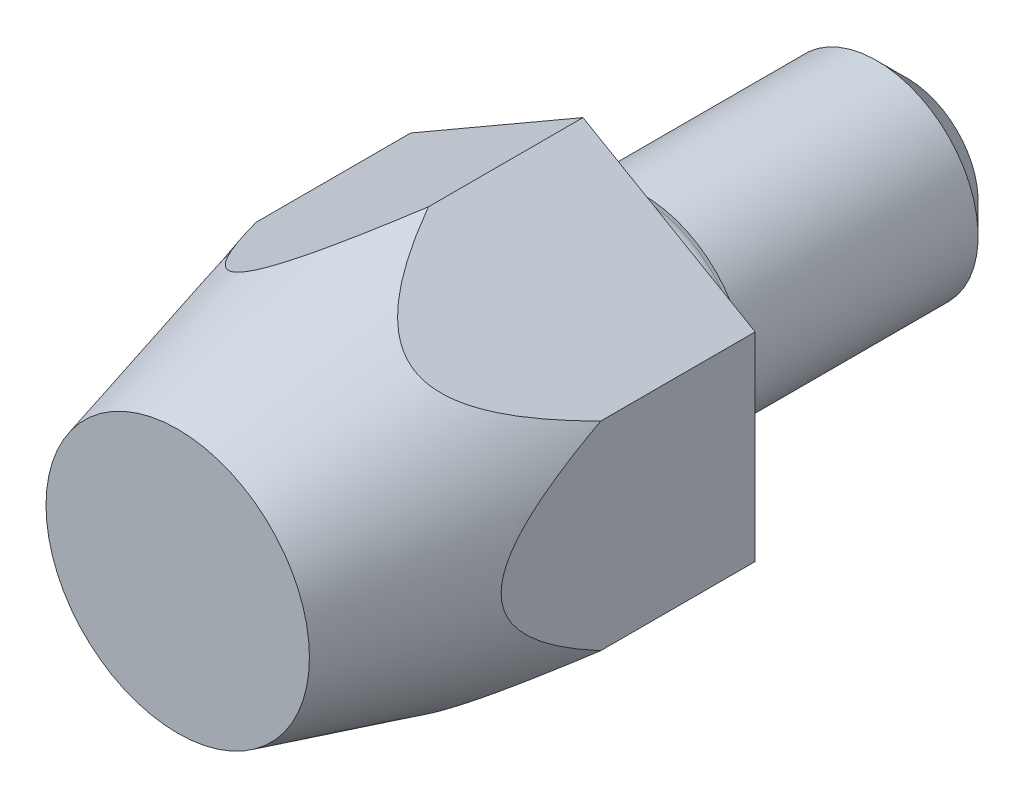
ISO-10303-21;
HEADER;
FILE_DESCRIPTION(('STEP AP214'),'2;1');
FILE_NAME('part.step','',(''),(''),'','','');
FILE_SCHEMA(('AUTOMOTIVE_DESIGN { 1 0 10303 214 1 1 1 1 }'));
ENDSEC;
DATA;
#1=APPLICATION_CONTEXT('core data for automotive mechanical design processes');
#2=APPLICATION_PROTOCOL_DEFINITION('international standard','automotive_design',2000,#1);
#3=PRODUCT_CONTEXT('',#1,'mechanical');
#4=PRODUCT('Part','Part','',(#3));
#5=PRODUCT_RELATED_PRODUCT_CATEGORY('part','',(#4));
#6=PRODUCT_DEFINITION_FORMATION('','',#4);
#7=PRODUCT_DEFINITION_CONTEXT('part definition',#1,'design');
#8=PRODUCT_DEFINITION('design','',#6,#7);
#9=PRODUCT_DEFINITION_SHAPE('','',#8);
#10=(LENGTH_UNIT() NAMED_UNIT(*) SI_UNIT(.MILLI.,.METRE.));
#11=(NAMED_UNIT(*) PLANE_ANGLE_UNIT() SI_UNIT($,.RADIAN.));
#12=(NAMED_UNIT(*) SI_UNIT($,.STERADIAN.) SOLID_ANGLE_UNIT());
#13=UNCERTAINTY_MEASURE_WITH_UNIT(LENGTH_MEASURE(1.E-05),#10,'distance_accuracy_value','');
#14=(GEOMETRIC_REPRESENTATION_CONTEXT(3) GLOBAL_UNCERTAINTY_ASSIGNED_CONTEXT((#13)) GLOBAL_UNIT_ASSIGNED_CONTEXT((#10,
#11,#12)) REPRESENTATION_CONTEXT('',''));
#15=CARTESIAN_POINT('',(0.,0.,0.));
#16=DIRECTION('',(0.,0.,1.));
#17=DIRECTION('',(1.,0.,0.));
#18=AXIS2_PLACEMENT_3D('',#15,#16,#17);
#19=CARTESIAN_POINT('',(-11.8589838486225,0.,0.));
#20=DIRECTION('',(0.,0.,-1.));
#21=DIRECTION('',(-1.,0.,0.));
#22=AXIS2_PLACEMENT_3D('',#19,#20,#21);
#23=PLANE('',#22);
#24=CARTESIAN_POINT('',(0.,0.,0.));
#25=DIRECTION('',(0.,0.,-1.));
#26=DIRECTION('',(-1.,0.,0.));
#27=AXIS2_PLACEMENT_3D('',#24,#25,#26);
#28=CIRCLE('',#27,4.8);
#29=CARTESIAN_POINT('',(-4.8,0.,0.));
#30=VERTEX_POINT('',#29);
#31=EDGE_CURVE('E22',#30,#30,#28,.F.);
#32=ORIENTED_EDGE('',*,*,#31,.T.);
#33=EDGE_LOOP('',(#32));
#34=FACE_BOUND('',#33,.T.);
#35=DIRECTION('',(0.,1.,0.));
#36=VECTOR('',#35,1.);
#37=CARTESIAN_POINT('',(8.5,-4.90747728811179,0.));
#38=LINE('',#37,#36);
#39=CARTESIAN_POINT('',(8.5,-4.90747728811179,0.));
#40=VERTEX_POINT('',#39);
#41=CARTESIAN_POINT('',(8.5,4.90747728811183,0.));
#42=VERTEX_POINT('',#41);
#43=EDGE_CURVE('E97',#40,#42,#38,.T.);
#44=ORIENTED_EDGE('',*,*,#43,.F.);
#45=DIRECTION('',(-0.866025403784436,-0.5,0.));
#46=VECTOR('',#45,1.);
#47=CARTESIAN_POINT('',(8.5,-4.90747728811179,0.));
#48=LINE('',#47,#46);
#49=CARTESIAN_POINT('',(0.,-9.81495457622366,0.));
#50=VERTEX_POINT('',#49);
#51=EDGE_CURVE('E90',#40,#50,#48,.T.);
#52=ORIENTED_EDGE('',*,*,#51,.T.);
#53=DIRECTION('',(0.866025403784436,-0.5,0.));
#54=VECTOR('',#53,1.);
#55=CARTESIAN_POINT('',(-8.5,-4.90747728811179,0.));
#56=LINE('',#55,#54);
#57=CARTESIAN_POINT('',(-8.5,-4.90747728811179,0.));
#58=VERTEX_POINT('',#57);
#59=EDGE_CURVE('E88',#58,#50,#56,.T.);
#60=ORIENTED_EDGE('',*,*,#59,.F.);
#61=DIRECTION('',(0.,1.,0.));
#62=VECTOR('',#61,1.);
#63=CARTESIAN_POINT('',(-8.5,-4.90747728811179,0.));
#64=LINE('',#63,#62);
#65=CARTESIAN_POINT('',(-8.5,4.90747728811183,0.));
#66=VERTEX_POINT('',#65);
#67=EDGE_CURVE('E37',#58,#66,#64,.T.);
#68=ORIENTED_EDGE('',*,*,#67,.T.);
#69=DIRECTION('',(0.86602540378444,0.5,0.));
#70=VECTOR('',#69,1.);
#71=CARTESIAN_POINT('',(-8.5,4.90747728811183,0.));
#72=LINE('',#71,#70);
#73=CARTESIAN_POINT('',(0.,9.81495457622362,0.));
#74=VERTEX_POINT('',#73);
#75=EDGE_CURVE('E77',#66,#74,#72,.T.);
#76=ORIENTED_EDGE('',*,*,#75,.T.);
#77=DIRECTION('',(-0.86602540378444,0.5,0.));
#78=VECTOR('',#77,1.);
#79=CARTESIAN_POINT('',(8.5,4.90747728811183,0.));
#80=LINE('',#79,#78);
#81=EDGE_CURVE('E83',#42,#74,#80,.T.);
#82=ORIENTED_EDGE('',*,*,#81,.F.);
#83=EDGE_LOOP('',(#44,#52,#60,#68,#76,#82));
#84=FACE_BOUND('',#83,.T.);
#85=ADVANCED_FACE('F14',(#34,#84),#23,.T.);
#86=CARTESIAN_POINT('',(8.5,-4.90747728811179,30.));
#87=DIRECTION('',(0.5,-0.866025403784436,0.));
#88=DIRECTION('',(0.866025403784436,0.5,0.));
#89=AXIS2_PLACEMENT_3D('',#86,#87,#88);
#90=PLANE('',#89);
#91=DIRECTION('',(0.,0.,-1.));
#92=VECTOR('',#91,1.);
#93=CARTESIAN_POINT('',(0.,-9.81495457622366,30.));
#94=LINE('',#93,#92);
#95=CARTESIAN_POINT('',(0.,-9.8149545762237,7.62842109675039));
#96=VERTEX_POINT('',#95);
#97=EDGE_CURVE('E29',#96,#50,#94,.T.);
#98=ORIENTED_EDGE('',*,*,#97,.T.);
#99=ORIENTED_EDGE('',*,*,#51,.F.);
#100=DIRECTION('',(0.,0.,-1.));
#101=VECTOR('',#100,1.);
#102=CARTESIAN_POINT('',(8.5,-4.90747728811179,30.));
#103=LINE('',#102,#101);
#104=CARTESIAN_POINT('',(8.5,-4.90747728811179,7.62842109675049));
#105=VERTEX_POINT('',#104);
#106=EDGE_CURVE('E102',#105,#40,#103,.T.);
#107=ORIENTED_EDGE('',*,*,#106,.F.);
#108=CARTESIAN_POINT('',(-0.000200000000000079,-9.8150700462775,7.62799014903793));
#109=CARTESIAN_POINT('',(0.0565623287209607,-9.7822983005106,7.75029290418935));
#110=CARTESIAN_POINT('',(0.113980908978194,-9.74914766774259,7.87218853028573));
#111=CARTESIAN_POINT('',(0.23028254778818,-9.68200088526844,8.11505767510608));
#112=CARTESIAN_POINT('',(0.289165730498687,-9.64800466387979,8.23603111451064));
#113=CARTESIAN_POINT('',(0.468440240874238,-9.54450047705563,8.59780847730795));
#114=CARTESIAN_POINT('',(0.591253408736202,-9.4735942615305,8.83702862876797));
#115=CARTESIAN_POINT('',(0.846354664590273,-9.32631148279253,9.31259125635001));
#116=CARTESIAN_POINT('',(0.978737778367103,-9.24988005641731,9.54886604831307));
#117=CARTESIAN_POINT('',(1.25378264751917,-9.09108282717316,10.0131621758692));
#118=CARTESIAN_POINT('',(1.39643609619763,-9.00872182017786,10.2411899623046));
#119=CARTESIAN_POINT('',(1.61637758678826,-8.88173854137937,10.5679844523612));
#120=CARTESIAN_POINT('',(1.68842753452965,-8.84014048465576,10.6714546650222));
#121=CARTESIAN_POINT('',(1.83600172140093,-8.75493848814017,10.8750743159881));
#122=CARTESIAN_POINT('',(1.91152636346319,-8.71133431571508,10.9752233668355));
#123=CARTESIAN_POINT('',(2.0664957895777,-8.62186267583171,11.1713042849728));
#124=CARTESIAN_POINT('',(2.14593801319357,-8.57599668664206,11.2672388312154));
#125=CARTESIAN_POINT('',(2.3093516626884,-8.48164977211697,11.4537883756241));
#126=CARTESIAN_POINT('',(2.39332214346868,-8.43316939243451,11.5444044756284));
#127=CARTESIAN_POINT('',(2.61555054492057,-8.30486576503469,11.7683512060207));
#128=CARTESIAN_POINT('',(2.75760492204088,-8.22285063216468,11.8967851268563));
#129=CARTESIAN_POINT('',(3.05665849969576,-8.05019196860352,12.1279669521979));
#130=CARTESIAN_POINT('',(3.21361248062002,-7.95957454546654,12.2307893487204));
#131=CARTESIAN_POINT('',(3.48807751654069,-7.80111208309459,12.3698897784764));
#132=CARTESIAN_POINT('',(3.60143379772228,-7.73566580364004,12.4169283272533));
#133=CARTESIAN_POINT('',(3.83329039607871,-7.60180333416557,12.4889998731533));
#134=CARTESIAN_POINT('',(3.9517836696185,-7.53339121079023,12.5140620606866));
#135=CARTESIAN_POINT('',(4.19149502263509,-7.39499379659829,12.53911377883));
#136=CARTESIAN_POINT('',(4.31272475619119,-7.32500177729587,12.5389600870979));
#137=CARTESIAN_POINT('',(4.5531322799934,-7.18620242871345,12.5132499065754));
#138=CARTESIAN_POINT('',(4.67230877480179,-7.11739584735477,12.4876779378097));
#139=CARTESIAN_POINT('',(4.92988312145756,-6.96868522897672,12.4066601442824));
#140=CARTESIAN_POINT('',(5.06703611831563,-6.88949990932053,12.3460526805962));
#141=CARTESIAN_POINT('',(5.33126816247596,-6.73694546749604,12.2005195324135));
#142=CARTESIAN_POINT('',(5.45832337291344,-6.66359010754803,12.1155383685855));
#143=CARTESIAN_POINT('',(5.68877154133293,-6.53054079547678,11.9389162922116));
#144=CARTESIAN_POINT('',(5.79322360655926,-6.47023536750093,11.8490725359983));
#145=CARTESIAN_POINT('',(5.99515319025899,-6.35365126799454,11.65938757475));
#146=CARTESIAN_POINT('',(6.09262434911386,-6.29737626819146,11.5595374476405));
#147=CARTESIAN_POINT('',(6.28210577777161,-6.18797911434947,11.3517412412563));
#148=CARTESIAN_POINT('',(6.37407283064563,-6.13488191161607,11.243743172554));
#149=CARTESIAN_POINT('',(6.55266303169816,-6.03177281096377,11.0221313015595));
#150=CARTESIAN_POINT('',(6.63928830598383,-5.98175968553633,10.9085197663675));
#151=CARTESIAN_POINT('',(6.81304306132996,-5.88144233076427,10.6700093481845));
#152=CARTESIAN_POINT('',(6.89989417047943,-5.83129881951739,10.5448414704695));
#153=CARTESIAN_POINT('',(7.069272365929,-5.73350827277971,10.2906504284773));
#154=CARTESIAN_POINT('',(7.15179863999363,-5.68586170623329,10.1616265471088));
#155=CARTESIAN_POINT('',(7.39403516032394,-5.54600638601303,9.76967614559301));
#156=CARTESIAN_POINT('',(7.54818966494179,-5.45700524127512,9.50217249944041));
#157=CARTESIAN_POINT('',(7.83980957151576,-5.28863840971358,8.96921965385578));
#158=CARTESIAN_POINT('',(7.97768204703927,-5.20903769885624,8.70406272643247));
#159=CARTESIAN_POINT('',(8.17815750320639,-5.09329314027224,8.30272384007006));
#160=CARTESIAN_POINT('',(8.24382448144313,-5.05538029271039,8.16856679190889));
#161=CARTESIAN_POINT('',(8.37333001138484,-4.980610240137,7.89910246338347));
#162=CARTESIAN_POINT('',(8.43716879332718,-4.94375290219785,7.76379533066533));
#163=CARTESIAN_POINT('',(8.50020000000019,-4.90736181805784,7.62799014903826));
#164=B_SPLINE_CURVE_WITH_KNOTS('',3,(#108,#109,#110,#111,#112,#113,#114,#115,#116,#117,#118,
#119,#120,#121,#122,#123,#124,#125,#126,#127,#128,#129,#130,#131,#132,#133,#134,#135,#136,#137,
#138,#139,#140,#141,#142,#143,#144,#145,#146,#147,#148,#149,#150,#151,#152,#153,#154,#155,#156,
#157,#158,#159,#160,#161,#162,#163),.UNSPECIFIED.,.F.,.F.,(4,2,2,2,2,2,2,2,2,2,2,2,2,2,2,2,2,2,
2,2,2,2,2,2,2,2,2,4),(0.,0.416269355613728,0.832574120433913,1.66668109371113,2.51067143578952,
3.35398666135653,3.75221416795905,4.15048797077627,4.54850483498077,4.94643894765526,
5.56989408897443,6.19151414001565,6.60723967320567,7.02241217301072,7.43994287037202,
7.85772800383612,8.36359455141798,8.87062181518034,9.32115341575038,9.7720903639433,
10.2261980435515,10.680123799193,11.1611365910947,11.6422393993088,12.6056109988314,
13.5332254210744,13.9955173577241,14.4577508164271),.UNSPECIFIED.);
#165=EDGE_CURVE('E157',#96,#105,#164,.T.);
#166=ORIENTED_EDGE('',*,*,#165,.F.);
#167=EDGE_LOOP('',(#98,#99,#107,#166));
#168=FACE_BOUND('',#167,.T.);
#169=ADVANCED_FACE('F127',(#168),#90,.T.);
#170=CARTESIAN_POINT('',(8.5,-4.90747728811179,30.));
#171=DIRECTION('',(-1.,0.,0.));
#172=DIRECTION('',(0.,0.,1.));
#173=AXIS2_PLACEMENT_3D('',#170,#171,#172);
#174=PLANE('',#173);
#175=CARTESIAN_POINT('',(8.5,-10.0492779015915,-4.8628859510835));
#176=CARTESIAN_POINT('',(8.5,-9.85410268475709,-4.30687724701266));
#177=CARTESIAN_POINT('',(8.5,-9.65689373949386,-3.75157278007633));
#178=CARTESIAN_POINT('',(8.5,-9.25741342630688,-2.64267011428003));
#179=CARTESIAN_POINT('',(8.5,-9.05514110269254,-2.08907226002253));
#180=CARTESIAN_POINT('',(8.5,-8.64297065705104,-0.97967301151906));
#181=CARTESIAN_POINT('',(8.5,-8.4330244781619,-0.423889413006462));
#182=CARTESIAN_POINT('',(8.5,-8.00569416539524,0.684730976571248));
#183=CARTESIAN_POINT('',(8.5,-7.78831100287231,1.23756814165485));
#184=CARTESIAN_POINT('',(8.5,-7.31428291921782,2.41388203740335));
#185=CARTESIAN_POINT('',(8.5,-7.05629847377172,3.03682367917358));
#186=CARTESIAN_POINT('',(8.5,-6.6572799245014,3.96623738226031));
#187=CARTESIAN_POINT('',(8.5,-6.5222334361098,4.27528123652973));
#188=CARTESIAN_POINT('',(8.5,-6.24742270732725,4.89126326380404));
#189=CARTESIAN_POINT('',(8.5,-6.10765855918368,5.19820147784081));
#190=CARTESIAN_POINT('',(8.5,-5.82308398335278,5.80828138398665));
#191=CARTESIAN_POINT('',(8.5,-5.67829533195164,6.11143320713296));
#192=CARTESIAN_POINT('',(8.5,-5.38201744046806,6.71444147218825));
#193=CARTESIAN_POINT('',(8.5,-5.23052852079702,7.01429807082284));
#194=CARTESIAN_POINT('',(8.5,-4.91942475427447,7.60949511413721));
#195=CARTESIAN_POINT('',(8.5,-4.75981607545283,7.90483877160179));
#196=CARTESIAN_POINT('',(8.5,-4.4302954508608,8.48969606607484));
#197=CARTESIAN_POINT('',(8.5,-4.26038599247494,8.77921108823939));
#198=CARTESIAN_POINT('',(8.5,-4.0133208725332,9.17849342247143));
#199=CARTESIAN_POINT('',(8.5,-3.94177652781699,9.2917388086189));
#200=CARTESIAN_POINT('',(8.5,-3.79628704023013,9.51668328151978));
#201=CARTESIAN_POINT('',(8.5,-3.72234180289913,9.62838230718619));
#202=CARTESIAN_POINT('',(8.5,-3.49635051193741,9.96096268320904));
#203=CARTESIAN_POINT('',(8.5,-3.34026820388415,10.1791320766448));
#204=CARTESIAN_POINT('',(8.5,-3.0164983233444,10.6022478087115));
#205=CARTESIAN_POINT('',(8.5,-2.84899560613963,10.8073327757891));
#206=CARTESIAN_POINT('',(8.5,-2.58473089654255,11.1031284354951));
#207=CARTESIAN_POINT('',(8.5,-2.49453248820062,11.1997003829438));
#208=CARTESIAN_POINT('',(8.5,-2.30911453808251,11.3878742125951));
#209=CARTESIAN_POINT('',(8.5,-2.2138969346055,11.4794779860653));
#210=CARTESIAN_POINT('',(8.5,-2.05038700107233,11.6268722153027));
#211=CARTESIAN_POINT('',(8.5,-1.98368987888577,11.6844287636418));
#212=CARTESIAN_POINT('',(8.5,-1.84752379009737,11.7961520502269));
#213=CARTESIAN_POINT('',(8.5,-1.77805484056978,11.8503188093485));
#214=CARTESIAN_POINT('',(8.5,-1.56493820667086,12.006937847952));
#215=CARTESIAN_POINT('',(8.5,-1.41671836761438,12.1033813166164));
#216=CARTESIAN_POINT('',(8.5,-1.10470500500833,12.2743652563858));
#217=CARTESIAN_POINT('',(8.5,-0.940703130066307,12.3485372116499));
#218=CARTESIAN_POINT('',(8.5,-0.601287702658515,12.4627994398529));
#219=CARTESIAN_POINT('',(8.5,-0.425917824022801,12.50301268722));
#220=CARTESIAN_POINT('',(8.5,-0.093791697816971,12.5392021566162));
#221=CARTESIAN_POINT('',(8.5,0.0623969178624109,12.5402790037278));
#222=CARTESIAN_POINT('',(8.5,0.371765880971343,12.5108305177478));
#223=CARTESIAN_POINT('',(8.5,0.524943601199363,12.4802787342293));
#224=CARTESIAN_POINT('',(8.5,0.840158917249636,12.387330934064));
#225=CARTESIAN_POINT('',(8.5,1.00120736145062,12.3216936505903));
#226=CARTESIAN_POINT('',(8.5,1.31095143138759,12.1659734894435));
#227=CARTESIAN_POINT('',(8.5,1.459620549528,12.0758398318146));
#228=CARTESIAN_POINT('',(8.5,1.73193848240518,11.8875729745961));
#229=CARTESIAN_POINT('',(8.5,1.85663291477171,11.7909153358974));
#230=CARTESIAN_POINT('',(8.5,2.0974268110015,11.5873351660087));
#231=CARTESIAN_POINT('',(8.5,2.21351826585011,11.4804032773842));
#232=CARTESIAN_POINT('',(8.5,2.43921615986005,11.258087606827));
#233=CARTESIAN_POINT('',(8.5,2.54875764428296,11.1426385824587));
#234=CARTESIAN_POINT('',(8.5,2.76135549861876,10.906071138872));
#235=CARTESIAN_POINT('',(8.5,2.86441532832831,10.7849558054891));
#236=CARTESIAN_POINT('',(8.5,3.06040356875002,10.5440656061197));
#237=CARTESIAN_POINT('',(8.5,3.15358031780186,10.4244915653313));
#238=CARTESIAN_POINT('',(8.5,3.33567224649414,10.1821333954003));
#239=CARTESIAN_POINT('',(8.5,3.4245868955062,10.0593488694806));
#240=CARTESIAN_POINT('',(8.5,3.68591339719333,9.68698480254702));
#241=CARTESIAN_POINT('',(8.5,3.85280207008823,9.43352791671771));
#242=CARTESIAN_POINT('',(8.5,4.17583930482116,8.91868334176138));
#243=CARTESIAN_POINT('',(8.5,4.33194695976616,8.65727034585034));
#244=CARTESIAN_POINT('',(8.5,4.63518718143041,8.1292673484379));
#245=CARTESIAN_POINT('',(8.5,4.78231859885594,7.86267668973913));
#246=CARTESIAN_POINT('',(8.5,5.05827691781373,7.34628104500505));
#247=CARTESIAN_POINT('',(8.5,5.18764137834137,7.09676164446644));
#248=CARTESIAN_POINT('',(8.5,5.44120419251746,6.59508547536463));
#249=CARTESIAN_POINT('',(8.5,5.56540201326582,6.34292843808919));
#250=CARTESIAN_POINT('',(8.5,5.8083614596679,5.83869518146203));
#251=CARTESIAN_POINT('',(8.5,5.9271607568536,5.58663705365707));
#252=CARTESIAN_POINT('',(8.5,6.16100872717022,5.08085328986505));
#253=CARTESIAN_POINT('',(8.5,6.2760582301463,4.82712803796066));
#254=CARTESIAN_POINT('',(8.5,6.38953763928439,4.57271355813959));
#255=B_SPLINE_CURVE_WITH_KNOTS('',3,(#175,#176,#177,#178,#179,#180,#181,#182,#183,#184,#185,
#186,#187,#188,#189,#190,#191,#192,#193,#194,#195,#196,#197,#198,#199,#200,#201,#202,#203,#204,
#205,#206,#207,#208,#209,#210,#211,#212,#213,#214,#215,#216,#217,#218,#219,#220,#221,#222,#223,
#224,#225,#226,#227,#228,#229,#230,#231,#232,#233,#234,#235,#236,#237,#238,#239,#240,#241,#242,
#243,#244,#245,#246,#247,#248,#249,#250,#251,#252,#253,#254),.UNSPECIFIED.,.F.,.F.,(4,2,2,2,2,2,
2,2,2,2,2,2,2,2,2,2,2,2,2,2,2,2,2,2,2,2,2,2,2,2,2,2,2,2,2,2,2,2,2,4),(0.,1.76781912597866,
3.53597447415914,5.31827341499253,7.10034044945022,9.12289522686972,10.1346507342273,
11.1463864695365,12.1541813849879,13.1619281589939,14.16892052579,15.1756706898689,
15.5775005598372,15.9793462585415,16.7837234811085,17.5772549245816,17.9735433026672,
18.3696797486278,18.6338730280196,18.8980646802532,19.4270081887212,19.9642744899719,
20.4995867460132,20.9648417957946,21.4304862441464,21.949365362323,22.4693284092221,
22.941949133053,23.4150044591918,23.8921613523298,24.3690613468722,24.8237242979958,
25.2784437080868,26.1883916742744,27.1016215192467,28.0149680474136,28.8580823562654,
29.7012834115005,30.5372058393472,31.3729420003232),.UNSPECIFIED.);
#256=CARTESIAN_POINT('',(8.5,4.90747728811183,7.62842109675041));
#257=VERTEX_POINT('',#256);
#258=EDGE_CURVE('E151',#257,#105,#255,.F.);
#259=ORIENTED_EDGE('',*,*,#258,.T.);
#260=ORIENTED_EDGE('',*,*,#106,.T.);
#261=ORIENTED_EDGE('',*,*,#43,.T.);
#262=DIRECTION('',(0.,0.,-1.));
#263=VECTOR('',#262,1.);
#264=CARTESIAN_POINT('',(8.5,4.90747728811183,30.));
#265=LINE('',#264,#263);
#266=EDGE_CURVE('E100',#257,#42,#265,.T.);
#267=ORIENTED_EDGE('',*,*,#266,.F.);
#268=EDGE_LOOP('',(#259,#260,#261,#267));
#269=FACE_BOUND('',#268,.T.);
#270=ADVANCED_FACE('F163',(#269),#174,.F.);
#271=CARTESIAN_POINT('',(8.5,4.90747728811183,30.));
#272=DIRECTION('',(-0.5,-0.86602540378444,0.));
#273=DIRECTION('',(0.86602540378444,-0.5,0.));
#274=AXIS2_PLACEMENT_3D('',#271,#272,#273);
#275=PLANE('',#274);
#276=CARTESIAN_POINT('',(-0.000200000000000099,9.81507004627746,7.62799014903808));
#277=CARTESIAN_POINT('',(0.0565623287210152,9.78229830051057,7.75029290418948));
#278=CARTESIAN_POINT('',(0.113980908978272,9.74914766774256,7.87218853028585));
#279=CARTESIAN_POINT('',(0.230282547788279,9.68200088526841,8.1150576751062));
#280=CARTESIAN_POINT('',(0.289165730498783,9.64800466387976,8.23603111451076));
#281=CARTESIAN_POINT('',(0.468440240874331,9.54450047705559,8.59780847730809));
#282=CARTESIAN_POINT('',(0.591253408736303,9.47359426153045,8.83702862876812));
#283=CARTESIAN_POINT('',(0.846354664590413,9.32631148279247,9.31259125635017));
#284=CARTESIAN_POINT('',(0.978737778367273,9.24988005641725,9.54886604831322));
#285=CARTESIAN_POINT('',(1.2537826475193,9.09108282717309,10.0131621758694));
#286=CARTESIAN_POINT('',(1.39643609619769,9.00872182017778,10.2411899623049));
#287=CARTESIAN_POINT('',(1.61637758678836,8.8817385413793,10.5679844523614));
#288=CARTESIAN_POINT('',(1.68842753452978,8.8401404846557,10.6714546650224));
#289=CARTESIAN_POINT('',(1.83600172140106,8.75493848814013,10.8750743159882));
#290=CARTESIAN_POINT('',(1.9115263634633,8.71133431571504,10.9752233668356));
#291=CARTESIAN_POINT('',(2.06649578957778,8.62186267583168,11.1713042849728));
#292=CARTESIAN_POINT('',(2.14593801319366,8.57599668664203,11.2672388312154));
#293=CARTESIAN_POINT('',(2.30935166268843,8.48164977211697,11.4537883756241));
#294=CARTESIAN_POINT('',(2.39332214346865,8.43316939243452,11.5444044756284));
#295=CARTESIAN_POINT('',(2.61555054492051,8.30486576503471,11.7683512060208));
#296=CARTESIAN_POINT('',(2.75760492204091,8.22285063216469,11.8967851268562));
#297=CARTESIAN_POINT('',(3.05665849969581,8.05019196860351,12.1279669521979));
#298=CARTESIAN_POINT('',(3.21361248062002,7.95957454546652,12.2307893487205));
#299=CARTESIAN_POINT('',(3.48807751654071,7.80111208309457,12.3698897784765));
#300=CARTESIAN_POINT('',(3.60143379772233,7.73566580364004,12.4169283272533));
#301=CARTESIAN_POINT('',(3.83329039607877,7.60180333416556,12.4889998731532));
#302=CARTESIAN_POINT('',(3.95178366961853,7.53339121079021,12.5140620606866));
#303=CARTESIAN_POINT('',(4.1914950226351,7.39499379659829,12.53911377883));
#304=CARTESIAN_POINT('',(4.3127247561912,7.32500177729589,12.5389600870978));
#305=CARTESIAN_POINT('',(4.55313227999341,7.18620242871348,12.5132499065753));
#306=CARTESIAN_POINT('',(4.67230877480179,7.11739584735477,12.4876779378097));
#307=CARTESIAN_POINT('',(4.92988312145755,6.96868522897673,12.4066601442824));
#308=CARTESIAN_POINT('',(5.06703611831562,6.88949990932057,12.3460526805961));
#309=CARTESIAN_POINT('',(5.33126816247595,6.73694546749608,12.2005195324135));
#310=CARTESIAN_POINT('',(5.45832337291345,6.66359010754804,12.1155383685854));
#311=CARTESIAN_POINT('',(5.68877154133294,6.53054079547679,11.9389162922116));
#312=CARTESIAN_POINT('',(5.79322360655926,6.47023536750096,11.8490725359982));
#313=CARTESIAN_POINT('',(5.99515319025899,6.35365126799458,11.6593875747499));
#314=CARTESIAN_POINT('',(6.09262434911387,6.29737626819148,11.5595374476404));
#315=CARTESIAN_POINT('',(6.28210577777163,6.18797911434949,11.3517412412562));
#316=CARTESIAN_POINT('',(6.37407283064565,6.1348819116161,11.2437431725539));
#317=CARTESIAN_POINT('',(6.55266303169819,6.03177281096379,11.0221313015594));
#318=CARTESIAN_POINT('',(6.63928830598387,5.98175968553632,10.9085197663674));
#319=CARTESIAN_POINT('',(6.81304306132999,5.88144233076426,10.6700093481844));
#320=CARTESIAN_POINT('',(6.89989417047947,5.8312988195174,10.5448414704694));
#321=CARTESIAN_POINT('',(7.06927236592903,5.73350827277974,10.2906504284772));
#322=CARTESIAN_POINT('',(7.15179863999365,5.68586170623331,10.1616265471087));
#323=CARTESIAN_POINT('',(7.39403516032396,5.54600638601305,9.7696761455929));
#324=CARTESIAN_POINT('',(7.5481896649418,5.45700524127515,9.5021724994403));
#325=CARTESIAN_POINT('',(7.83980957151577,5.28863840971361,8.96921965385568));
#326=CARTESIAN_POINT('',(7.97768204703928,5.20903769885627,8.70406272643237));
#327=CARTESIAN_POINT('',(8.1781575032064,5.09329314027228,8.30272384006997));
#328=CARTESIAN_POINT('',(8.24382448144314,5.05538029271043,8.1685667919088));
#329=CARTESIAN_POINT('',(8.37333001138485,4.98061024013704,7.89910246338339));
#330=CARTESIAN_POINT('',(8.43716879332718,4.94375290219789,7.76379533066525));
#331=CARTESIAN_POINT('',(8.5002000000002,4.90736181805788,7.62799014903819));
#332=B_SPLINE_CURVE_WITH_KNOTS('',3,(#276,#277,#278,#279,#280,#281,#282,#283,#284,#285,#286,
#287,#288,#289,#290,#291,#292,#293,#294,#295,#296,#297,#298,#299,#300,#301,#302,#303,#304,#305,
#306,#307,#308,#309,#310,#311,#312,#313,#314,#315,#316,#317,#318,#319,#320,#321,#322,#323,#324,
#325,#326,#327,#328,#329,#330,#331),.UNSPECIFIED.,.F.,.F.,(4,2,2,2,2,2,2,2,2,2,2,2,2,2,2,2,2,2,
2,2,2,2,2,2,2,2,2,4),(0.,0.416269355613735,0.832574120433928,1.66668109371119,2.51067143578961,
3.35398666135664,3.75221416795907,4.15048797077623,4.54850483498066,4.94643894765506,
5.56989408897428,6.19151414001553,6.60723967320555,7.02241217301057,7.43994287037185,
7.85772800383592,8.3635945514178,8.87062181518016,9.32115341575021,9.77209036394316,
10.2261980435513,10.6801237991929,11.1611365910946,11.6422393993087,12.6056109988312,
13.5332254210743,13.9955173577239,14.4577508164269),.UNSPECIFIED.);
#333=CARTESIAN_POINT('',(0.,9.81495457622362,7.6284210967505));
#334=VERTEX_POINT('',#333);
#335=EDGE_CURVE('E145',#334,#257,#332,.T.);
#336=ORIENTED_EDGE('',*,*,#335,.T.);
#337=ORIENTED_EDGE('',*,*,#266,.T.);
#338=ORIENTED_EDGE('',*,*,#81,.T.);
#339=DIRECTION('',(0.,0.,-1.));
#340=VECTOR('',#339,1.);
#341=CARTESIAN_POINT('',(0.,9.81495457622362,30.));
#342=LINE('',#341,#340);
#343=EDGE_CURVE('E73',#334,#74,#342,.T.);
#344=ORIENTED_EDGE('',*,*,#343,.F.);
#345=EDGE_LOOP('',(#336,#337,#338,#344));
#346=FACE_BOUND('',#345,.T.);
#347=ADVANCED_FACE('F136',(#346),#275,.F.);
#348=CARTESIAN_POINT('',(-8.5,4.90747728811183,30.));
#349=DIRECTION('',(-0.5,0.86602540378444,0.));
#350=DIRECTION('',(-0.86602540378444,-0.5,0.));
#351=AXIS2_PLACEMENT_3D('',#348,#349,#350);
#352=PLANE('',#351);
#353=ORIENTED_EDGE('',*,*,#343,.T.);
#354=ORIENTED_EDGE('',*,*,#75,.F.);
#355=DIRECTION('',(0.,0.,-1.));
#356=VECTOR('',#355,1.);
#357=CARTESIAN_POINT('',(-8.5,4.90747728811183,30.));
#358=LINE('',#357,#356);
#359=CARTESIAN_POINT('',(-8.5,4.90747728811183,7.62842109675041));
#360=VERTEX_POINT('',#359);
#361=EDGE_CURVE('E66',#360,#66,#358,.T.);
#362=ORIENTED_EDGE('',*,*,#361,.F.);
#363=CARTESIAN_POINT('',(0.0001999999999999,9.81507004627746,7.62799014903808));
#364=CARTESIAN_POINT('',(-0.056562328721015,9.78229830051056,7.75029290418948));
#365=CARTESIAN_POINT('',(-0.113980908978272,9.74914766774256,7.87218853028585));
#366=CARTESIAN_POINT('',(-0.23028254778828,9.68200088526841,8.1150576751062));
#367=CARTESIAN_POINT('',(-0.289165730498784,9.64800466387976,8.23603111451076));
#368=CARTESIAN_POINT('',(-0.468440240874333,9.54450047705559,8.5978084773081));
#369=CARTESIAN_POINT('',(-0.591253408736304,9.47359426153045,8.83702862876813));
#370=CARTESIAN_POINT('',(-0.846354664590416,9.32631148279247,9.31259125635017));
#371=CARTESIAN_POINT('',(-0.97873777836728,9.24988005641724,9.54886604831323));
#372=CARTESIAN_POINT('',(-1.2537826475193,9.09108282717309,10.0131621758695));
#373=CARTESIAN_POINT('',(-1.39643609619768,9.00872182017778,10.2411899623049));
#374=CARTESIAN_POINT('',(-1.61637758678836,8.8817385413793,10.5679844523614));
#375=CARTESIAN_POINT('',(-1.68842753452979,8.84014048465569,10.6714546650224));
#376=CARTESIAN_POINT('',(-1.83600172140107,8.75493848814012,10.8750743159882));
#377=CARTESIAN_POINT('',(-1.9115263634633,8.71133431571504,10.9752233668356));
#378=CARTESIAN_POINT('',(-2.06649578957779,8.62186267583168,11.1713042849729));
#379=CARTESIAN_POINT('',(-2.14593801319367,8.57599668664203,11.2672388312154));
#380=CARTESIAN_POINT('',(-2.30935166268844,8.48164977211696,11.4537883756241));
#381=CARTESIAN_POINT('',(-2.39332214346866,8.43316939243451,11.5444044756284));
#382=CARTESIAN_POINT('',(-2.61555054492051,8.30486576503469,11.7683512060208));
#383=CARTESIAN_POINT('',(-2.75760492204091,8.22285063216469,11.8967851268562));
#384=CARTESIAN_POINT('',(-3.05665849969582,8.05019196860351,12.1279669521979));
#385=CARTESIAN_POINT('',(-3.21361248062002,7.95957454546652,12.2307893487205));
#386=CARTESIAN_POINT('',(-3.48807751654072,7.80111208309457,12.3698897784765));
#387=CARTESIAN_POINT('',(-3.60143379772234,7.73566580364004,12.4169283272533));
#388=CARTESIAN_POINT('',(-3.83329039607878,7.60180333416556,12.4889998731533));
#389=CARTESIAN_POINT('',(-3.95178366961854,7.5333912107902,12.5140620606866));
#390=CARTESIAN_POINT('',(-4.1914950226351,7.39499379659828,12.53911377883));
#391=CARTESIAN_POINT('',(-4.3127247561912,7.32500177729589,12.5389600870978));
#392=CARTESIAN_POINT('',(-4.55313227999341,7.18620242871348,12.5132499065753));
#393=CARTESIAN_POINT('',(-4.6723087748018,7.11739584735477,12.4876779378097));
#394=CARTESIAN_POINT('',(-4.92988312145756,6.96868522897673,12.4066601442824));
#395=CARTESIAN_POINT('',(-5.06703611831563,6.88949990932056,12.3460526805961));
#396=CARTESIAN_POINT('',(-5.33126816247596,6.73694546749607,12.2005195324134));
#397=CARTESIAN_POINT('',(-5.45832337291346,6.66359010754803,12.1155383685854));
#398=CARTESIAN_POINT('',(-5.68877154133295,6.53054079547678,11.9389162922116));
#399=CARTESIAN_POINT('',(-5.79322360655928,6.47023536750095,11.8490725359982));
#400=CARTESIAN_POINT('',(-5.995153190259,6.35365126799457,11.6593875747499));
#401=CARTESIAN_POINT('',(-6.09262434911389,6.29737626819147,11.5595374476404));
#402=CARTESIAN_POINT('',(-6.28210577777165,6.18797911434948,11.3517412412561));
#403=CARTESIAN_POINT('',(-6.37407283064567,6.13488191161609,11.2437431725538));
#404=CARTESIAN_POINT('',(-6.55266303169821,6.03177281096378,11.0221313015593));
#405=CARTESIAN_POINT('',(-6.63928830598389,5.98175968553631,10.9085197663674));
#406=CARTESIAN_POINT('',(-6.81304306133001,5.88144233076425,10.6700093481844));
#407=CARTESIAN_POINT('',(-6.89989417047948,5.83129881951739,10.5448414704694));
#408=CARTESIAN_POINT('',(-7.06927236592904,5.73350827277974,10.2906504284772));
#409=CARTESIAN_POINT('',(-7.15179863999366,5.68586170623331,10.1616265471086));
#410=CARTESIAN_POINT('',(-7.39403516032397,5.54600638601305,9.76967614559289));
#411=CARTESIAN_POINT('',(-7.54818966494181,5.45700524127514,9.50217249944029));
#412=CARTESIAN_POINT('',(-7.83980957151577,5.28863840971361,8.96921965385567));
#413=CARTESIAN_POINT('',(-7.97768204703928,5.20903769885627,8.70406272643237));
#414=CARTESIAN_POINT('',(-8.1781575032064,5.09329314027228,8.30272384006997));
#415=CARTESIAN_POINT('',(-8.24382448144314,5.05538029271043,8.1685667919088));
#416=CARTESIAN_POINT('',(-8.37333001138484,4.98061024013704,7.89910246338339));
#417=CARTESIAN_POINT('',(-8.43716879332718,4.94375290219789,7.76379533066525));
#418=CARTESIAN_POINT('',(-8.50020000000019,4.90736181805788,7.62799014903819));
#419=B_SPLINE_CURVE_WITH_KNOTS('',3,(#363,#364,#365,#366,#367,#368,#369,#370,#371,#372,#373,
#374,#375,#376,#377,#378,#379,#380,#381,#382,#383,#384,#385,#386,#387,#388,#389,#390,#391,#392,
#393,#394,#395,#396,#397,#398,#399,#400,#401,#402,#403,#404,#405,#406,#407,#408,#409,#410,#411,
#412,#413,#414,#415,#416,#417,#418),.UNSPECIFIED.,.F.,.F.,(4,2,2,2,2,2,2,2,2,2,2,2,2,2,2,2,2,2,
2,2,2,2,2,2,2,2,2,4),(0.,0.416269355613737,0.832574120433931,1.66668109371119,2.51067143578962,
3.35398666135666,3.75221416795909,4.15048797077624,4.54850483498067,4.94643894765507,
5.56989408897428,6.19151414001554,6.60723967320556,7.02241217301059,7.43994287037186,
7.85772800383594,8.36359455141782,8.87062181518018,9.32115341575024,9.77209036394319,
10.2261980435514,10.6801237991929,11.1611365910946,11.6422393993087,12.6056109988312,
13.5332254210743,13.9955173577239,14.4577508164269),.UNSPECIFIED.);
#420=EDGE_CURVE('E139',#334,#360,#419,.T.);
#421=ORIENTED_EDGE('',*,*,#420,.F.);
#422=EDGE_LOOP('',(#353,#354,#362,#421));
#423=FACE_BOUND('',#422,.T.);
#424=ADVANCED_FACE('F78',(#423),#352,.T.);
#425=CARTESIAN_POINT('',(-8.5,-4.90747728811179,30.));
#426=DIRECTION('',(-1.,0.,0.));
#427=DIRECTION('',(0.,0.,1.));
#428=AXIS2_PLACEMENT_3D('',#425,#426,#427);
#429=PLANE('',#428);
#430=ORIENTED_EDGE('',*,*,#361,.T.);
#431=ORIENTED_EDGE('',*,*,#67,.F.);
#432=DIRECTION('',(0.,0.,-1.));
#433=VECTOR('',#432,1.);
#434=CARTESIAN_POINT('',(-8.5,-4.90747728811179,30.));
#435=LINE('',#434,#433);
#436=CARTESIAN_POINT('',(-8.5,-4.90747728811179,7.62842109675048));
#437=VERTEX_POINT('',#436);
#438=EDGE_CURVE('E74',#437,#58,#435,.T.);
#439=ORIENTED_EDGE('',*,*,#438,.F.);
#440=CARTESIAN_POINT('',(-8.5,-10.0492779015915,-4.8628859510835));
#441=CARTESIAN_POINT('',(-8.5,-9.85410268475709,-4.30687724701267));
#442=CARTESIAN_POINT('',(-8.5,-9.65689373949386,-3.75157278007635));
#443=CARTESIAN_POINT('',(-8.5,-9.2574134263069,-2.64267011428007));
#444=CARTESIAN_POINT('',(-8.5,-9.05514110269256,-2.08907226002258));
#445=CARTESIAN_POINT('',(-8.5,-8.64297065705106,-0.979673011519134));
#446=CARTESIAN_POINT('',(-8.5,-8.43302447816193,-0.423889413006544));
#447=CARTESIAN_POINT('',(-8.5,-8.00569416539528,0.684730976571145));
#448=CARTESIAN_POINT('',(-8.5,-7.78831100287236,1.23756814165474));
#449=CARTESIAN_POINT('',(-8.5,-7.31428291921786,2.41388203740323));
#450=CARTESIAN_POINT('',(-8.5,-7.05629847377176,3.03682367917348));
#451=CARTESIAN_POINT('',(-8.5,-6.65727992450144,3.96623738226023));
#452=CARTESIAN_POINT('',(-8.5,-6.52223343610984,4.27528123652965));
#453=CARTESIAN_POINT('',(-8.5,-6.24742270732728,4.89126326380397));
#454=CARTESIAN_POINT('',(-8.5,-6.10765855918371,5.19820147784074));
#455=CARTESIAN_POINT('',(-8.5,-5.82308398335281,5.80828138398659));
#456=CARTESIAN_POINT('',(-8.5,-5.67829533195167,6.1114332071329));
#457=CARTESIAN_POINT('',(-8.5,-5.38201744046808,6.71444147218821));
#458=CARTESIAN_POINT('',(-8.5,-5.23052852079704,7.0142980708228));
#459=CARTESIAN_POINT('',(-8.5,-4.91942475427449,7.60949511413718));
#460=CARTESIAN_POINT('',(-8.5,-4.75981607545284,7.90483877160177));
#461=CARTESIAN_POINT('',(-8.5,-4.43029545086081,8.48969606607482));
#462=CARTESIAN_POINT('',(-8.5,-4.26038599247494,8.77921108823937));
#463=CARTESIAN_POINT('',(-8.5,-4.0133208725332,9.17849342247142));
#464=CARTESIAN_POINT('',(-8.5,-3.94177652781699,9.29173880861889));
#465=CARTESIAN_POINT('',(-8.5,-3.79628704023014,9.51668328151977));
#466=CARTESIAN_POINT('',(-8.5,-3.72234180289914,9.62838230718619));
#467=CARTESIAN_POINT('',(-8.5,-3.49635051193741,9.96096268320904));
#468=CARTESIAN_POINT('',(-8.5,-3.34026820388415,10.1791320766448));
#469=CARTESIAN_POINT('',(-8.5,-3.01649832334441,10.6022478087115));
#470=CARTESIAN_POINT('',(-8.5,-2.84899560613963,10.8073327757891));
#471=CARTESIAN_POINT('',(-8.5,-2.58473089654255,11.1031284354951));
#472=CARTESIAN_POINT('',(-8.5,-2.49453248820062,11.1997003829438));
#473=CARTESIAN_POINT('',(-8.5,-2.30911453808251,11.3878742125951));
#474=CARTESIAN_POINT('',(-8.5,-2.2138969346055,11.4794779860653));
#475=CARTESIAN_POINT('',(-8.5,-2.05038700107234,11.6268722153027));
#476=CARTESIAN_POINT('',(-8.5,-1.98368987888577,11.6844287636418));
#477=CARTESIAN_POINT('',(-8.5,-1.84752379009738,11.7961520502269));
#478=CARTESIAN_POINT('',(-8.5,-1.77805484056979,11.8503188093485));
#479=CARTESIAN_POINT('',(-8.5,-1.56493820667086,12.006937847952));
#480=CARTESIAN_POINT('',(-8.5,-1.41671836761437,12.1033813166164));
#481=CARTESIAN_POINT('',(-8.5,-1.10470500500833,12.2743652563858));
#482=CARTESIAN_POINT('',(-8.5,-0.940703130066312,12.3485372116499));
#483=CARTESIAN_POINT('',(-8.5,-0.601287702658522,12.4627994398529));
#484=CARTESIAN_POINT('',(-8.5,-0.425917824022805,12.50301268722));
#485=CARTESIAN_POINT('',(-8.5,-0.0937916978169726,12.5392021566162));
#486=CARTESIAN_POINT('',(-8.5,0.0623969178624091,12.5402790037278));
#487=CARTESIAN_POINT('',(-8.5,0.371765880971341,12.5108305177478));
#488=CARTESIAN_POINT('',(-8.5,0.524943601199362,12.4802787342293));
#489=CARTESIAN_POINT('',(-8.5,0.840158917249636,12.387330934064));
#490=CARTESIAN_POINT('',(-8.5,1.00120736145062,12.3216936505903));
#491=CARTESIAN_POINT('',(-8.5,1.31095143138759,12.1659734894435));
#492=CARTESIAN_POINT('',(-8.5,1.459620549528,12.0758398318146));
#493=CARTESIAN_POINT('',(-8.5,1.73193848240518,11.8875729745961));
#494=CARTESIAN_POINT('',(-8.5,1.85663291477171,11.7909153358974));
#495=CARTESIAN_POINT('',(-8.5,2.0974268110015,11.5873351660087));
#496=CARTESIAN_POINT('',(-8.5,2.21351826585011,11.4804032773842));
#497=CARTESIAN_POINT('',(-8.5,2.43921615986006,11.258087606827));
#498=CARTESIAN_POINT('',(-8.5,2.54875764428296,11.1426385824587));
#499=CARTESIAN_POINT('',(-8.5,2.76135549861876,10.906071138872));
#500=CARTESIAN_POINT('',(-8.5,2.86441532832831,10.7849558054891));
#501=CARTESIAN_POINT('',(-8.5,3.06040356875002,10.5440656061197));
#502=CARTESIAN_POINT('',(-8.5,3.15358031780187,10.4244915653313));
#503=CARTESIAN_POINT('',(-8.5,3.33567224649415,10.1821333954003));
#504=CARTESIAN_POINT('',(-8.5,3.4245868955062,10.0593488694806));
#505=CARTESIAN_POINT('',(-8.5,3.68591339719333,9.68698480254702));
#506=CARTESIAN_POINT('',(-8.5,3.85280207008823,9.4335279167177));
#507=CARTESIAN_POINT('',(-8.5,4.17583930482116,8.91868334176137));
#508=CARTESIAN_POINT('',(-8.5,4.33194695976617,8.65727034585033));
#509=CARTESIAN_POINT('',(-8.5,4.63518718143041,8.12926734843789));
#510=CARTESIAN_POINT('',(-8.5,4.78231859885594,7.86267668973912));
#511=CARTESIAN_POINT('',(-8.5,5.05827691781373,7.34628104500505));
#512=CARTESIAN_POINT('',(-8.5,5.18764137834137,7.09676164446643));
#513=CARTESIAN_POINT('',(-8.5,5.44120419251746,6.59508547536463));
#514=CARTESIAN_POINT('',(-8.5,5.56540201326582,6.34292843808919));
#515=CARTESIAN_POINT('',(-8.5,5.8083614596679,5.83869518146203));
#516=CARTESIAN_POINT('',(-8.5,5.9271607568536,5.58663705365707));
#517=CARTESIAN_POINT('',(-8.5,6.16100872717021,5.08085328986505));
#518=CARTESIAN_POINT('',(-8.5,6.2760582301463,4.82712803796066));
#519=CARTESIAN_POINT('',(-8.5,6.38953763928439,4.57271355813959));
#520=B_SPLINE_CURVE_WITH_KNOTS('',3,(#440,#441,#442,#443,#444,#445,#446,#447,#448,#449,#450,
#451,#452,#453,#454,#455,#456,#457,#458,#459,#460,#461,#462,#463,#464,#465,#466,#467,#468,#469,
#470,#471,#472,#473,#474,#475,#476,#477,#478,#479,#480,#481,#482,#483,#484,#485,#486,#487,#488,
#489,#490,#491,#492,#493,#494,#495,#496,#497,#498,#499,#500,#501,#502,#503,#504,#505,#506,#507,
#508,#509,#510,#511,#512,#513,#514,#515,#516,#517,#518,#519),.UNSPECIFIED.,.F.,.F.,(4,2,2,2,2,2,
2,2,2,2,2,2,2,2,2,2,2,2,2,2,2,2,2,2,2,2,2,2,2,2,2,2,2,2,2,2,2,2,2,4),(0.,1.76781912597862,
3.53597447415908,5.31827341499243,7.10034044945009,9.12289522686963,10.1346507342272,
11.1463864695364,12.1541813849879,13.1619281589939,14.16892052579,15.1756706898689,
15.5775005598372,15.9793462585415,16.7837234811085,17.5772549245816,17.9735433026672,
18.3696797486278,18.6338730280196,18.8980646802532,19.4270081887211,19.9642744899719,
20.4995867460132,20.9648417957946,21.4304862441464,21.949365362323,22.4693284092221,
22.941949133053,23.4150044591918,23.8921613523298,24.3690613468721,24.8237242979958,
25.2784437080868,26.1883916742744,27.1016215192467,28.0149680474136,28.8580823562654,
29.7012834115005,30.5372058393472,31.3729420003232),.UNSPECIFIED.);
#521=EDGE_CURVE('E70',#360,#437,#520,.F.);
#522=ORIENTED_EDGE('',*,*,#521,.F.);
#523=EDGE_LOOP('',(#430,#431,#439,#522));
#524=FACE_BOUND('',#523,.T.);
#525=ADVANCED_FACE('F68',(#524),#429,.T.);
#526=CARTESIAN_POINT('',(-8.5,-4.90747728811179,30.));
#527=DIRECTION('',(0.5,0.866025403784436,0.));
#528=DIRECTION('',(-0.866025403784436,0.5,0.));
#529=AXIS2_PLACEMENT_3D('',#526,#527,#528);
#530=PLANE('',#529);
#531=CARTESIAN_POINT('',(0.000199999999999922,-9.8150700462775,7.62799014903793));
#532=CARTESIAN_POINT('',(-0.0565623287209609,-9.7822983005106,7.75029290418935));
#533=CARTESIAN_POINT('',(-0.113980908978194,-9.74914766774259,7.87218853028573));
#534=CARTESIAN_POINT('',(-0.230282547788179,-9.68200088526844,8.11505767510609));
#535=CARTESIAN_POINT('',(-0.289165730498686,-9.64800466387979,8.23603111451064));
#536=CARTESIAN_POINT('',(-0.468440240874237,-9.54450047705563,8.59780847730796));
#537=CARTESIAN_POINT('',(-0.591253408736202,-9.4735942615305,8.83702862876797));
#538=CARTESIAN_POINT('',(-0.846354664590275,-9.32631148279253,9.31259125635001));
#539=CARTESIAN_POINT('',(-0.978737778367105,-9.24988005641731,9.54886604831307));
#540=CARTESIAN_POINT('',(-1.25378264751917,-9.09108282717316,10.0131621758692));
#541=CARTESIAN_POINT('',(-1.39643609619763,-9.00872182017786,10.2411899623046));
#542=CARTESIAN_POINT('',(-1.61637758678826,-8.88173854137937,10.5679844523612));
#543=CARTESIAN_POINT('',(-1.68842753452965,-8.84014048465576,10.6714546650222));
#544=CARTESIAN_POINT('',(-1.83600172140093,-8.75493848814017,10.8750743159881));
#545=CARTESIAN_POINT('',(-1.91152636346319,-8.71133431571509,10.9752233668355));
#546=CARTESIAN_POINT('',(-2.0664957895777,-8.62186267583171,11.1713042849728));
#547=CARTESIAN_POINT('',(-2.14593801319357,-8.57599668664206,11.2672388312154));
#548=CARTESIAN_POINT('',(-2.3093516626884,-8.48164977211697,11.4537883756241));
#549=CARTESIAN_POINT('',(-2.39332214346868,-8.43316939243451,11.5444044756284));
#550=CARTESIAN_POINT('',(-2.61555054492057,-8.30486576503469,11.7683512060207));
#551=CARTESIAN_POINT('',(-2.75760492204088,-8.22285063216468,11.8967851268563));
#552=CARTESIAN_POINT('',(-3.05665849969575,-8.05019196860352,12.1279669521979));
#553=CARTESIAN_POINT('',(-3.21361248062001,-7.95957454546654,12.2307893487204));
#554=CARTESIAN_POINT('',(-3.48807751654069,-7.80111208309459,12.3698897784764));
#555=CARTESIAN_POINT('',(-3.60143379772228,-7.73566580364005,12.4169283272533));
#556=CARTESIAN_POINT('',(-3.83329039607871,-7.60180333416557,12.4889998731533));
#557=CARTESIAN_POINT('',(-3.9517836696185,-7.53339121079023,12.5140620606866));
#558=CARTESIAN_POINT('',(-4.19149502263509,-7.39499379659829,12.53911377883));
#559=CARTESIAN_POINT('',(-4.31272475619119,-7.32500177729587,12.5389600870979));
#560=CARTESIAN_POINT('',(-4.5531322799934,-7.18620242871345,12.5132499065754));
#561=CARTESIAN_POINT('',(-4.67230877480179,-7.11739584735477,12.4876779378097));
#562=CARTESIAN_POINT('',(-4.92988312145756,-6.96868522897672,12.4066601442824));
#563=CARTESIAN_POINT('',(-5.06703611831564,-6.88949990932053,12.3460526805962));
#564=CARTESIAN_POINT('',(-5.33126816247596,-6.73694546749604,12.2005195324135));
#565=CARTESIAN_POINT('',(-5.45832337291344,-6.66359010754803,12.1155383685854));
#566=CARTESIAN_POINT('',(-5.68877154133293,-6.53054079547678,11.9389162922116));
#567=CARTESIAN_POINT('',(-5.79322360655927,-6.47023536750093,11.8490725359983));
#568=CARTESIAN_POINT('',(-5.99515319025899,-6.35365126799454,11.65938757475));
#569=CARTESIAN_POINT('',(-6.09262434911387,-6.29737626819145,11.5595374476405));
#570=CARTESIAN_POINT('',(-6.28210577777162,-6.18797911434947,11.3517412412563));
#571=CARTESIAN_POINT('',(-6.37407283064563,-6.13488191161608,11.243743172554));
#572=CARTESIAN_POINT('',(-6.55266303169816,-6.03177281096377,11.0221313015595));
#573=CARTESIAN_POINT('',(-6.63928830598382,-5.98175968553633,10.9085197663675));
#574=CARTESIAN_POINT('',(-6.81304306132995,-5.88144233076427,10.6700093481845));
#575=CARTESIAN_POINT('',(-6.89989417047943,-5.83129881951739,10.5448414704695));
#576=CARTESIAN_POINT('',(-7.069272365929,-5.73350827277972,10.2906504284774));
#577=CARTESIAN_POINT('',(-7.15179863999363,-5.68586170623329,10.1616265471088));
#578=CARTESIAN_POINT('',(-7.39403516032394,-5.54600638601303,9.76967614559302));
#579=CARTESIAN_POINT('',(-7.54818966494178,-5.45700524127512,9.50217249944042));
#580=CARTESIAN_POINT('',(-7.83980957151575,-5.28863840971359,8.9692196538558));
#581=CARTESIAN_POINT('',(-7.97768204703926,-5.20903769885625,8.70406272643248));
#582=CARTESIAN_POINT('',(-8.17815750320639,-5.09329314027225,8.30272384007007));
#583=CARTESIAN_POINT('',(-8.24382448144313,-5.05538029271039,8.16856679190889));
#584=CARTESIAN_POINT('',(-8.37333001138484,-4.980610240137,7.89910246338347));
#585=CARTESIAN_POINT('',(-8.43716879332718,-4.94375290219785,7.76379533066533));
#586=CARTESIAN_POINT('',(-8.5002000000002,-4.90736181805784,7.62799014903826));
#587=B_SPLINE_CURVE_WITH_KNOTS('',3,(#531,#532,#533,#534,#535,#536,#537,#538,#539,#540,#541,
#542,#543,#544,#545,#546,#547,#548,#549,#550,#551,#552,#553,#554,#555,#556,#557,#558,#559,#560,
#561,#562,#563,#564,#565,#566,#567,#568,#569,#570,#571,#572,#573,#574,#575,#576,#577,#578,#579,
#580,#581,#582,#583,#584,#585,#586),.UNSPECIFIED.,.F.,.F.,(4,2,2,2,2,2,2,2,2,2,2,2,2,2,2,2,2,2,
2,2,2,2,2,2,2,2,2,4),(0.,0.416269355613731,0.832574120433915,1.66668109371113,2.51067143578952,
3.35398666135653,3.75221416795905,4.15048797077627,4.54850483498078,4.94643894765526,
5.56989408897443,6.19151414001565,6.60723967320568,7.02241217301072,7.43994287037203,
7.85772800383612,8.36359455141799,8.87062181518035,9.32115341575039,9.77209036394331,
10.2261980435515,10.680123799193,11.1611365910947,11.6422393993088,12.6056109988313,
13.5332254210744,13.9955173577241,14.4577508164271),.UNSPECIFIED.);
#588=EDGE_CURVE('E104',#96,#437,#587,.T.);
#589=ORIENTED_EDGE('',*,*,#588,.T.);
#590=ORIENTED_EDGE('',*,*,#438,.T.);
#591=ORIENTED_EDGE('',*,*,#59,.T.);
#592=ORIENTED_EDGE('',*,*,#97,.F.);
#593=EDGE_LOOP('',(#589,#590,#591,#592));
#594=FACE_BOUND('',#593,.T.);
#595=ADVANCED_FACE('F122',(#594),#530,.F.);
#596=CARTESIAN_POINT('',(0.,0.,20.));
#597=DIRECTION('',(0.,0.,1.));
#598=DIRECTION('',(1.,0.,0.));
#599=AXIS2_PLACEMENT_3D('',#596,#597,#598);
#600=PLANE('',#599);
#601=CARTESIAN_POINT('',(0.,0.,20.));
#602=DIRECTION('',(0.,0.,1.));
#603=DIRECTION('',(1.,0.,0.));
#604=AXIS2_PLACEMENT_3D('',#601,#602,#603);
#605=CIRCLE('',#604,6.5);
#606=CARTESIAN_POINT('',(6.5,0.,20.));
#607=VERTEX_POINT('',#606);
#608=EDGE_CURVE('E202',#607,#607,#605,.T.);
#609=ORIENTED_EDGE('',*,*,#608,.T.);
#610=EDGE_LOOP('',(#609));
#611=FACE_BOUND('',#610,.T.);
#612=ADVANCED_FACE('F126',(#611),#600,.T.);
#613=CARTESIAN_POINT('',(0.,0.,20.));
#614=DIRECTION('',(0.,0.,-1.));
#615=DIRECTION('',(-1.,0.,0.));
#616=AXIS2_PLACEMENT_3D('',#613,#614,#615);
#617=CONICAL_SURFACE('',#616,6.5,0.26179938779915);
#618=ORIENTED_EDGE('',*,*,#608,.F.);
#619=EDGE_LOOP('',(#618));
#620=FACE_BOUND('',#619,.T.);
#621=ORIENTED_EDGE('',*,*,#588,.F.);
#622=ORIENTED_EDGE('',*,*,#165,.T.);
#623=ORIENTED_EDGE('',*,*,#258,.F.);
#624=ORIENTED_EDGE('',*,*,#335,.F.);
#625=ORIENTED_EDGE('',*,*,#420,.T.);
#626=ORIENTED_EDGE('',*,*,#521,.T.);
#627=EDGE_LOOP('',(#621,#622,#623,#624,#625,#626));
#628=FACE_BOUND('',#627,.T.);
#629=ADVANCED_FACE('F118',(#620,#628),#617,.T.);
#630=CARTESIAN_POINT('',(0.,0.,-3.));
#631=DIRECTION('',(0.,0.,-1.));
#632=DIRECTION('',(-1.,0.,0.));
#633=AXIS2_PLACEMENT_3D('',#630,#631,#632);
#634=PLANE('',#633);
#635=CARTESIAN_POINT('',(0.,0.,-3.));
#636=DIRECTION('',(0.,0.,-1.));
#637=DIRECTION('',(-1.,0.,0.));
#638=AXIS2_PLACEMENT_3D('',#635,#636,#637);
#639=CIRCLE('',#638,4.8);
#640=CARTESIAN_POINT('',(-4.8,0.,-3.));
#641=VERTEX_POINT('',#640);
#642=EDGE_CURVE('E9',#641,#641,#639,.T.);
#643=ORIENTED_EDGE('',*,*,#642,.T.);
#644=EDGE_LOOP('',(#643));
#645=FACE_BOUND('',#644,.T.);
#646=CARTESIAN_POINT('',(0.,0.,-3.));
#647=DIRECTION('',(0.,0.,-1.));
#648=DIRECTION('',(-1.,0.,0.));
#649=AXIS2_PLACEMENT_3D('',#646,#647,#648);
#650=CIRCLE('',#649,5.);
#651=CARTESIAN_POINT('',(-5.,0.,-3.));
#652=VERTEX_POINT('',#651);
#653=EDGE_CURVE('E95',#652,#652,#650,.F.);
#654=ORIENTED_EDGE('',*,*,#653,.T.);
#655=EDGE_LOOP('',(#654));
#656=FACE_BOUND('',#655,.T.);
#657=ADVANCED_FACE('F252',(#645,#656),#634,.F.);
#658=CARTESIAN_POINT('',(0.,0.,-3.));
#659=DIRECTION('',(0.,0.,1.));
#660=DIRECTION('',(1.,0.,0.));
#661=AXIS2_PLACEMENT_3D('',#658,#659,#660);
#662=CYLINDRICAL_SURFACE('',#661,4.);
#663=CARTESIAN_POINT('',(0.,0.,-0.8));
#664=DIRECTION('',(0.,0.,-1.));
#665=DIRECTION('',(-1.,0.,0.));
#666=AXIS2_PLACEMENT_3D('',#663,#664,#665);
#667=CIRCLE('',#666,4.);
#668=CARTESIAN_POINT('',(-4.,0.,-0.8));
#669=VERTEX_POINT('',#668);
#670=EDGE_CURVE('E188',#669,#669,#667,.T.);
#671=ORIENTED_EDGE('',*,*,#670,.T.);
#672=EDGE_LOOP('',(#671));
#673=FACE_BOUND('',#672,.T.);
#674=CARTESIAN_POINT('',(0.,0.,-2.2));
#675=DIRECTION('',(0.,0.,-1.));
#676=DIRECTION('',(-1.,0.,0.));
#677=AXIS2_PLACEMENT_3D('',#674,#675,#676);
#678=CIRCLE('',#677,4.);
#679=CARTESIAN_POINT('',(-4.,0.,-2.2));
#680=VERTEX_POINT('',#679);
#681=EDGE_CURVE('E190',#680,#680,#678,.F.);
#682=ORIENTED_EDGE('',*,*,#681,.T.);
#683=EDGE_LOOP('',(#682));
#684=FACE_BOUND('',#683,.T.);
#685=ADVANCED_FACE('F172',(#673,#684),#662,.T.);
#686=CARTESIAN_POINT('',(-5.,0.,-16.));
#687=DIRECTION('',(0.,0.,-1.));
#688=DIRECTION('',(-1.,0.,0.));
#689=AXIS2_PLACEMENT_3D('',#686,#687,#688);
#690=PLANE('',#689);
#691=CARTESIAN_POINT('',(0.,0.,-16.));
#692=DIRECTION('',(0.,0.,-1.));
#693=DIRECTION('',(-1.,0.,0.));
#694=AXIS2_PLACEMENT_3D('',#691,#692,#693);
#695=CIRCLE('',#694,3.5);
#696=CARTESIAN_POINT('',(-3.5,0.,-16.));
#697=VERTEX_POINT('',#696);
#698=EDGE_CURVE('E195',#697,#697,#695,.T.);
#699=ORIENTED_EDGE('',*,*,#698,.T.);
#700=EDGE_LOOP('',(#699));
#701=FACE_BOUND('',#700,.T.);
#702=ADVANCED_FACE('F168',(#701),#690,.T.);
#703=CARTESIAN_POINT('',(0.,0.,-14.5));
#704=DIRECTION('',(0.,0.,1.));
#705=DIRECTION('',(1.,0.,0.));
#706=AXIS2_PLACEMENT_3D('',#703,#704,#705);
#707=CONICAL_SURFACE('',#706,5.,0.785398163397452);
#708=ORIENTED_EDGE('',*,*,#698,.F.);
#709=EDGE_LOOP('',(#708));
#710=FACE_BOUND('',#709,.T.);
#711=CARTESIAN_POINT('',(0.,0.,-14.5));
#712=DIRECTION('',(0.,0.,-1.));
#713=DIRECTION('',(-1.,0.,0.));
#714=AXIS2_PLACEMENT_3D('',#711,#712,#713);
#715=CIRCLE('',#714,5.);
#716=CARTESIAN_POINT('',(-5.,0.,-14.5));
#717=VERTEX_POINT('',#716);
#718=EDGE_CURVE('E200',#717,#717,#715,.F.);
#719=ORIENTED_EDGE('',*,*,#718,.F.);
#720=EDGE_LOOP('',(#719));
#721=FACE_BOUND('',#720,.T.);
#722=ADVANCED_FACE('F171',(#710,#721),#707,.T.);
#723=CARTESIAN_POINT('',(0.,0.,40.));
#724=DIRECTION('',(0.,0.,1.));
#725=DIRECTION('',(1.,0.,0.));
#726=AXIS2_PLACEMENT_3D('',#723,#724,#725);
#727=CYLINDRICAL_SURFACE('',#726,5.);
#728=ORIENTED_EDGE('',*,*,#653,.F.);
#729=EDGE_LOOP('',(#728));
#730=FACE_BOUND('',#729,.T.);
#731=ORIENTED_EDGE('',*,*,#718,.T.);
#732=EDGE_LOOP('',(#731));
#733=FACE_BOUND('',#732,.T.);
#734=ADVANCED_FACE('F174',(#730,#733),#727,.T.);
#735=CARTESIAN_POINT('',(0.,0.,-0.8));
#736=DIRECTION('',(0.,0.,-1.));
#737=DIRECTION('',(-1.,0.,0.));
#738=AXIS2_PLACEMENT_3D('',#735,#736,#737);
#739=TOROIDAL_SURFACE('',#738,4.8,0.8);
#740=ORIENTED_EDGE('',*,*,#31,.F.);
#741=EDGE_LOOP('',(#740));
#742=FACE_BOUND('',#741,.T.);
#743=ORIENTED_EDGE('',*,*,#670,.F.);
#744=EDGE_LOOP('',(#743));
#745=FACE_BOUND('',#744,.T.);
#746=ADVANCED_FACE('F176',(#742,#745),#739,.F.);
#747=CARTESIAN_POINT('',(0.,0.,-2.2));
#748=DIRECTION('',(0.,0.,-1.));
#749=DIRECTION('',(-1.,0.,0.));
#750=AXIS2_PLACEMENT_3D('',#747,#748,#749);
#751=TOROIDAL_SURFACE('',#750,4.8,0.8);
#752=ORIENTED_EDGE('',*,*,#681,.F.);
#753=EDGE_LOOP('',(#752));
#754=FACE_BOUND('',#753,.T.);
#755=ORIENTED_EDGE('',*,*,#642,.F.);
#756=EDGE_LOOP('',(#755));
#757=FACE_BOUND('',#756,.T.);
#758=ADVANCED_FACE('F16',(#754,#757),#751,.F.);
#759=CLOSED_SHELL('',(#85,#169,#270,#347,#424,#525,#595,#612,#629,#657,#685,#702,#722,#734,#746,#758));
#760=MANIFOLD_SOLID_BREP('B1',#759);
#761=ADVANCED_BREP_SHAPE_REPRESENTATION('',(#18,#760),#14);
#762=SHAPE_DEFINITION_REPRESENTATION(#9,#761);
ENDSEC;
END-ISO-10303-21;
